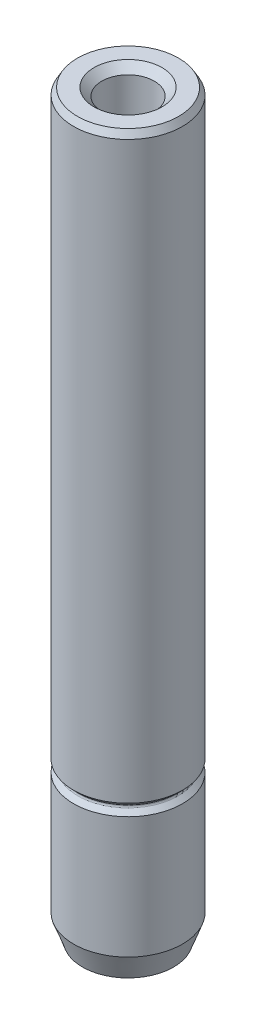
from build123d import *

# Parameters (mm, degrees)
CHAMFER1_SIZE  = 0.254
CHAMFER1_SIZE2 = 0.439940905
CHAMFER2_SIZE  = 0.508
FILLET1_R      = 0.127


with BuildPart() as part:
    # Sketch1 → Revolve1 (revolve)
    with BuildSketch(Plane.XY, mode=Mode.PRIVATE) as revolve1_sk:
        Polygon((-2.159, 0), (-2.159, 1.6002), (-1.7145, 1.6002), (-1.7145, 48.26), (-3.556, 48.26), (-3.556, 10.287), (-3.175, 9.906), (-3.556, 9.525), (-3.556, 1.5875), (-2.978197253, 0), align=None)
    revolve(revolve1_sk.sketch.rotate(Axis((0, 0, 0), (0, 1, 0)), 270), axis=Axis((0, 0, 0), (0, 1, 0)))

    # Chamfer1
    chamfer1_edges = [part.edges().sort_by_distance(p)[0] for p in [
        (0, 48.26, 3.556),
    ]]
    chamfer1_side = [part.faces().sort_by_distance(p)[0] for p in [
        (0, 48.26, 1.815078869),
    ]]
    chamfer(chamfer1_edges, length=CHAMFER1_SIZE, length2=CHAMFER1_SIZE2, reference=chamfer1_side[0])

    # Chamfer2
    chamfer2_edges = [part.edges().sort_by_distance(p)[0] for p in [
        (0, 48.26, 1.7145),
    ]]
    chamfer(chamfer2_edges, length=CHAMFER2_SIZE)

    # Fillet1
    fillet1_edges = [part.edges().sort_by_distance(p)[0] for p in [
        (0, 9.906, 3.175),
    ]]
    fillet(fillet1_edges, radius=FILLET1_R)


solid = part.part
